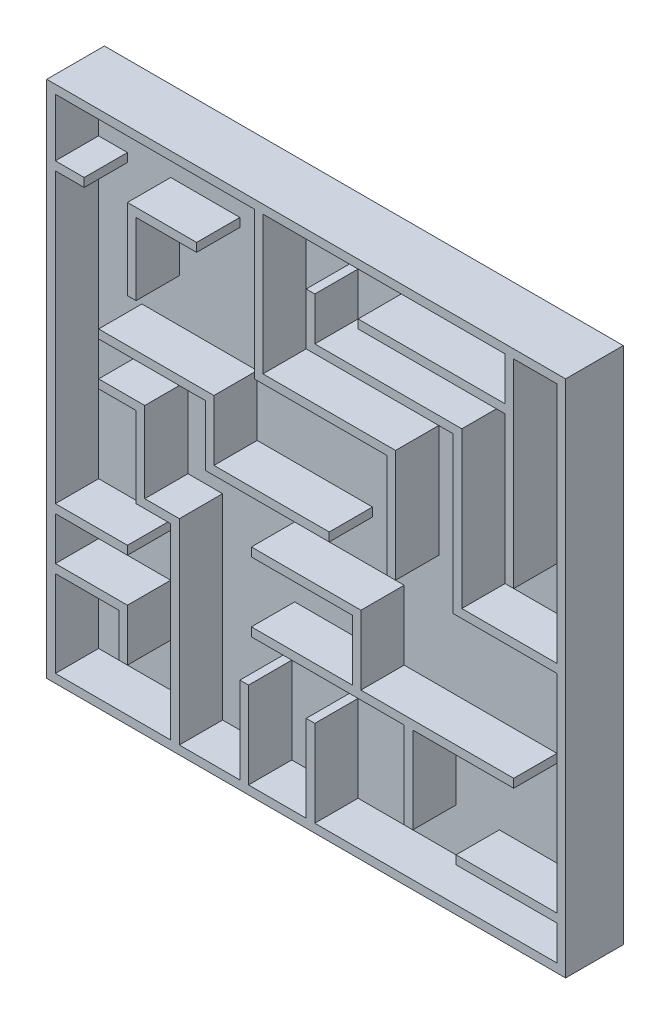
from build123d import *

# Parameters (mm, degrees)
SKIZZE1_W                       = 180
SKIZZE1_H                       = 180
AUFSATZ_LINEAR_AUSTRAGEN1_DEPTH = 5
SKIZZE2_W                       = 3
SKIZZE2_H                       = 3
SKIZZE2_W_2                     = 24
SKIZZE2_H_2                     = 25
SKIZZE2_W_3                     = 43
SKIZZE2_W_4                     = 40
SKIZZE2_W_5                     = 35
SKIZZE2_H_3                     = 65
SKIZZE2_W_6                     = 25
SKIZZE2_H_4                     = 15
SKIZZE2_H_5                     = 30
SKIZZE2_H_6                     = 33
SKIZZE2_H_7                     = 51
SKIZZE2_W_7                     = 51
SKIZZE2_W_8                     = 10
AUFSATZ_LINEAR_AUSTRAGEN2_DEPTH = 15
SKIZZE3_R                       = 20
AUFSATZ_LINEAR_AUSTRAGEN3_DEPTH = 5
ROTATION1_ANGLE                 = 180


with BuildPart() as part:
    # Skizze1 → Aufsatz-Linear austragen1 (new body)
    with BuildSketch(Plane.XY):
        with Locations((90, 90)):
            Rectangle(SKIZZE1_W, SKIZZE1_H)
    extrude(amount=AUFSATZ_LINEAR_AUSTRAGEN1_DEPTH)

    # Skizze2 → Aufsatz-Linear austragen2 (add)
    with BuildSketch(Plane.XY.offset(5)):
        Polygon((3, 177), (0, 177), (0, 3), (3, 3), (3, 33), (3, 36), (3, 51), (3, 54), (3, 154), (3, 157), align=None)
        Polygon((177, 180), (3, 180), (3, 177), (72, 177), (75, 177), (159, 177), (162, 177), (177, 177), align=None)
        with Locations((1.5, 178.5)):
            Rectangle(SKIZZE2_W, SKIZZE2_H)
        with Locations((40, 155.5)):
            Rectangle(SKIZZE2_W_2, SKIZZE2_H)
        with Locations((29.5, 141.5)):
            Rectangle(SKIZZE2_W, SKIZZE2_H_2)
        with Locations((96.5, 127.5)):
            Rectangle(SKIZZE2_W_3, SKIZZE2_H)
        Polygon((58, 93), (58, 111), (55, 111), (55, 90), (58, 90), align=None)
        with Locations((38, 112.5)):
            Rectangle(SKIZZE2_W_4, SKIZZE2_H)
        Polygon((18, 96), (31, 96), (34, 96), (34, 99), (18, 99), align=None)
        with Locations((32.5, 83.5)):
            Rectangle(SKIZZE2_W, SKIZZE2_H_2)
        Polygon((31, 68), (43, 68), (46, 68), (46, 71), (34, 71), (31, 71), align=None)
        with Locations((78, 91.5)):
            Rectangle(SKIZZE2_W_4, SKIZZE2_H)
        with Locations((88.5, 73.5)):
            Rectangle(SKIZZE2_W_5, SKIZZE2_H)
        with Locations((44.5, 35.5)):
            Rectangle(SKIZZE2_W, SKIZZE2_H_3)
        with Locations((15.5, 52.5)):
            Rectangle(SKIZZE2_W_6, SKIZZE2_H)
        Polygon((3, 36), (3, 33), (25, 33), (28, 33), (28, 36), align=None)
        with Locations((26.5, 25.5)):
            Rectangle(SKIZZE2_W, SKIZZE2_H_4)
        Polygon((43, 3), (3, 3), (3, 0), (177, 0), (177, 3), (93, 3), (90, 3), (70, 3), (67, 3), (46, 3), align=None)
        with Locations((1.5, 1.5)):
            Rectangle(SKIZZE2_W, SKIZZE2_H)
        with Locations((91.5, 18)):
            Rectangle(SKIZZE2_W, SKIZZE2_H_5)
        Polygon((106, 51), (109, 51), (109, 75), (106, 75), (106, 72), align=None)
        Polygon((106, 48), (124, 48), (124, 51), (109, 51), (106, 51), align=None)
        with Locations((88.5, 49.5)):
            Rectangle(SKIZZE2_W_5, SKIZZE2_H)
        with Locations((68.5, 18)):
            Rectangle(SKIZZE2_W, SKIZZE2_H_5)
        with Locations((125.5, 34.5)):
            Rectangle(SKIZZE2_W, SKIZZE2_H_6)
        with Locations((144.5, 49.5)):
            Rectangle(SKIZZE2_W_5, SKIZZE2_H)
        with Locations((159.5, 16.5)):
            Rectangle(SKIZZE2_W_5, SKIZZE2_H)
        Polygon((180, 177), (177, 177), (177, 93), (177, 90), (177, 18), (177, 15), (177, 3), (180, 3), align=None)
        with Locations((178.5, 1.5)):
            Rectangle(SKIZZE2_W, SKIZZE2_H)
        Polygon((121, 129), (118, 129), (118, 126), (118, 90), (121, 90), (121, 93), align=None)
        with Locations((142.5, 118.5)):
            Rectangle(SKIZZE2_W, SKIZZE2_H_7)
        Polygon((177, 90), (177, 93), (144, 93), (141, 93), (141, 90), align=None)
        Polygon((162, 108), (162, 177), (159, 177), (159, 162), (159, 159), (159, 108), align=None)
        with Locations((133.5, 160.5)):
            Rectangle(SKIZZE2_W_7, SKIZZE2_H)
        Polygon((141, 144), (144, 144), (144, 147), (93, 147), (90, 147), (90, 144), align=None)
        with Locations((91.5, 154.5)):
            Rectangle(SKIZZE2_W, SKIZZE2_H_4)
        Polygon((75, 177), (72, 177), (72, 126), (75, 126), (75, 129), align=None)
        with Locations((178.5, 178.5)):
            Rectangle(SKIZZE2_W, SKIZZE2_H)
        with Locations((8, 155.5)):
            Rectangle(SKIZZE2_W_8, SKIZZE2_H)
    extrude(amount=AUFSATZ_LINEAR_AUSTRAGEN2_DEPTH)

    # Skizze3 → Aufsatz-Linear austragen3 (add)
    with BuildSketch(Plane(origin=(0, 0, 0), x_dir=(-1, 0, 0), z_dir=(0, 0, -1))):
        with Locations((-90, 90)):
            Circle(SKIZZE3_R)
    extrude(amount=AUFSATZ_LINEAR_AUSTRAGEN3_DEPTH)

    # Skizze4 → Rotation1 (revolve)
    with BuildSketch(Plane(origin=(0, 0, -5), x_dir=(-1, 0, 0), z_dir=(0, 0, -1))):
        with BuildLine():
            Line((-90, 70), (-90, 110))
            ThreePointArc((-90, 110), (-70, 90), (-90, 70))
        make_face()
    revolve(axis=Axis((90, 70, -5), (0, -1, 0)), revolution_arc=ROTATION1_ANGLE)


solid = part.part
